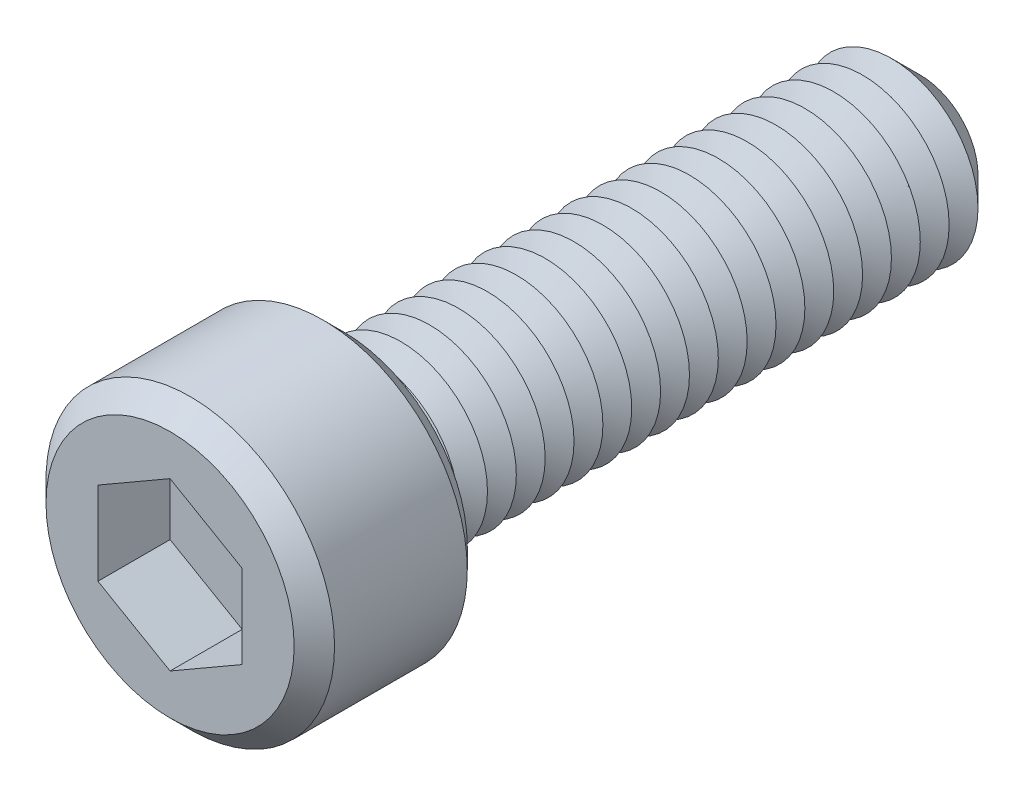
ISO-10303-21;
HEADER;
FILE_DESCRIPTION(('STEP AP214'),'2;1');
FILE_NAME('part.step','',(''),(''),'','','');
FILE_SCHEMA(('AUTOMOTIVE_DESIGN { 1 0 10303 214 1 1 1 1 }'));
ENDSEC;
DATA;
#1=APPLICATION_CONTEXT('core data for automotive mechanical design processes');
#2=APPLICATION_PROTOCOL_DEFINITION('international standard','automotive_design',2000,#1);
#3=PRODUCT_CONTEXT('',#1,'mechanical');
#4=PRODUCT('Part','Part','',(#3));
#5=PRODUCT_RELATED_PRODUCT_CATEGORY('part','',(#4));
#6=PRODUCT_DEFINITION_FORMATION('','',#4);
#7=PRODUCT_DEFINITION_CONTEXT('part definition',#1,'design');
#8=PRODUCT_DEFINITION('design','',#6,#7);
#9=PRODUCT_DEFINITION_SHAPE('','',#8);
#10=(LENGTH_UNIT() NAMED_UNIT(*) SI_UNIT(.MILLI.,.METRE.));
#11=(NAMED_UNIT(*) PLANE_ANGLE_UNIT() SI_UNIT($,.RADIAN.));
#12=(NAMED_UNIT(*) SI_UNIT($,.STERADIAN.) SOLID_ANGLE_UNIT());
#13=UNCERTAINTY_MEASURE_WITH_UNIT(LENGTH_MEASURE(1.E-05),#10,'distance_accuracy_value','');
#14=(GEOMETRIC_REPRESENTATION_CONTEXT(3) GLOBAL_UNCERTAINTY_ASSIGNED_CONTEXT((#13)) GLOBAL_UNIT_ASSIGNED_CONTEXT((#10,
#11,#12)) REPRESENTATION_CONTEXT('',''));
#15=CARTESIAN_POINT('',(0.,0.,0.));
#16=DIRECTION('',(0.,0.,1.));
#17=DIRECTION('',(1.,0.,0.));
#18=AXIS2_PLACEMENT_3D('',#15,#16,#17);
#19=CARTESIAN_POINT('',(0.,0.,6.));
#20=DIRECTION('',(0.,0.,-1.));
#21=DIRECTION('',(-1.,0.,0.));
#22=AXIS2_PLACEMENT_3D('',#19,#20,#21);
#23=CYLINDRICAL_SURFACE('',#22,5.);
#24=CARTESIAN_POINT('',(0.,0.,0.700000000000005));
#25=DIRECTION('',(0.,0.,1.));
#26=DIRECTION('',(1.,0.,0.));
#27=AXIS2_PLACEMENT_3D('',#24,#25,#26);
#28=CIRCLE('',#27,5.);
#29=CARTESIAN_POINT('',(5.,0.,0.700000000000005));
#30=VERTEX_POINT('',#29);
#31=EDGE_CURVE('E328',#30,#30,#28,.T.);
#32=ORIENTED_EDGE('',*,*,#31,.T.);
#33=EDGE_LOOP('',(#32));
#34=FACE_BOUND('',#33,.T.);
#35=CARTESIAN_POINT('',(0.,0.,5.29999999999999));
#36=DIRECTION('',(0.,0.,1.));
#37=DIRECTION('',(1.,0.,0.));
#38=AXIS2_PLACEMENT_3D('',#35,#36,#37);
#39=CIRCLE('',#38,5.);
#40=CARTESIAN_POINT('',(5.,0.,5.29999999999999));
#41=VERTEX_POINT('',#40);
#42=EDGE_CURVE('E324',#41,#41,#39,.F.);
#43=ORIENTED_EDGE('',*,*,#42,.T.);
#44=EDGE_LOOP('',(#43));
#45=FACE_BOUND('',#44,.T.);
#46=ADVANCED_FACE('F39',(#34,#45),#23,.T.);
#47=CARTESIAN_POINT('',(0.,0.,6.));
#48=DIRECTION('',(0.,0.,1.));
#49=DIRECTION('',(1.,0.,0.));
#50=AXIS2_PLACEMENT_3D('',#47,#48,#49);
#51=PLANE('',#50);
#52=CARTESIAN_POINT('',(0.,0.,6.));
#53=DIRECTION('',(0.,0.,1.));
#54=DIRECTION('',(1.,0.,0.));
#55=AXIS2_PLACEMENT_3D('',#52,#53,#54);
#56=CIRCLE('',#55,4.29999999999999);
#57=CARTESIAN_POINT('',(4.29999999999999,0.,6.));
#58=VERTEX_POINT('',#57);
#59=EDGE_CURVE('E11',#58,#58,#56,.T.);
#60=ORIENTED_EDGE('',*,*,#59,.T.);
#61=EDGE_LOOP('',(#60));
#62=FACE_BOUND('',#61,.T.);
#63=DIRECTION('',(-0.866025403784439,0.5,0.));
#64=VECTOR('',#63,1.);
#65=CARTESIAN_POINT('',(2.5,1.44337567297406,6.));
#66=LINE('',#65,#64);
#67=CARTESIAN_POINT('',(2.5,1.44337567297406,6.));
#68=VERTEX_POINT('',#67);
#69=CARTESIAN_POINT('',(0.,2.88675134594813,6.));
#70=VERTEX_POINT('',#69);
#71=EDGE_CURVE('E55',#68,#70,#66,.T.);
#72=ORIENTED_EDGE('',*,*,#71,.F.);
#73=DIRECTION('',(0.,1.,0.));
#74=VECTOR('',#73,1.);
#75=CARTESIAN_POINT('',(2.5,-1.44337567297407,6.));
#76=LINE('',#75,#74);
#77=CARTESIAN_POINT('',(2.5,-1.44337567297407,6.));
#78=VERTEX_POINT('',#77);
#79=EDGE_CURVE('E151',#78,#68,#76,.T.);
#80=ORIENTED_EDGE('',*,*,#79,.F.);
#81=DIRECTION('',(0.866025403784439,0.5,0.));
#82=VECTOR('',#81,1.);
#83=CARTESIAN_POINT('',(0.,-2.88675134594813,6.));
#84=LINE('',#83,#82);
#85=CARTESIAN_POINT('',(0.,-2.88675134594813,6.));
#86=VERTEX_POINT('',#85);
#87=EDGE_CURVE('E148',#86,#78,#84,.T.);
#88=ORIENTED_EDGE('',*,*,#87,.F.);
#89=DIRECTION('',(0.866025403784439,-0.5,0.));
#90=VECTOR('',#89,1.);
#91=CARTESIAN_POINT('',(-2.5,-1.44337567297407,6.));
#92=LINE('',#91,#90);
#93=CARTESIAN_POINT('',(-2.5,-1.44337567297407,6.));
#94=VERTEX_POINT('',#93);
#95=EDGE_CURVE('E103',#94,#86,#92,.T.);
#96=ORIENTED_EDGE('',*,*,#95,.F.);
#97=DIRECTION('',(0.,-1.,0.));
#98=VECTOR('',#97,1.);
#99=CARTESIAN_POINT('',(-2.5,1.44337567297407,6.));
#100=LINE('',#99,#98);
#101=CARTESIAN_POINT('',(-2.5,1.44337567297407,6.));
#102=VERTEX_POINT('',#101);
#103=EDGE_CURVE('E142',#102,#94,#100,.T.);
#104=ORIENTED_EDGE('',*,*,#103,.F.);
#105=DIRECTION('',(-0.866025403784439,-0.5,0.));
#106=VECTOR('',#105,1.);
#107=CARTESIAN_POINT('',(0.,2.88675134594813,6.));
#108=LINE('',#107,#106);
#109=EDGE_CURVE('E137',#70,#102,#108,.T.);
#110=ORIENTED_EDGE('',*,*,#109,.F.);
#111=EDGE_LOOP('',(#72,#80,#88,#96,#104,#110));
#112=FACE_BOUND('',#111,.T.);
#113=ADVANCED_FACE('F347',(#62,#112),#51,.T.);
#114=CARTESIAN_POINT('',(0.,0.,0.));
#115=DIRECTION('',(0.,0.,1.));
#116=DIRECTION('',(1.,0.,0.));
#117=AXIS2_PLACEMENT_3D('',#114,#115,#116);
#118=PLANE('',#117);
#119=CARTESIAN_POINT('',(0.,0.,0.));
#120=DIRECTION('',(0.,0.,1.));
#121=DIRECTION('',(1.,0.,0.));
#122=AXIS2_PLACEMENT_3D('',#119,#120,#121);
#123=CIRCLE('',#122,4.29999999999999);
#124=CARTESIAN_POINT('',(4.29999999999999,0.,0.));
#125=VERTEX_POINT('',#124);
#126=EDGE_CURVE('E48',#125,#125,#123,.F.);
#127=ORIENTED_EDGE('',*,*,#126,.T.);
#128=EDGE_LOOP('',(#127));
#129=FACE_BOUND('',#128,.T.);
#130=CARTESIAN_POINT('',(0.,0.,0.));
#131=DIRECTION('',(0.,0.,1.));
#132=DIRECTION('',(1.,0.,0.));
#133=AXIS2_PLACEMENT_3D('',#130,#131,#132);
#134=CIRCLE('',#133,3.);
#135=CARTESIAN_POINT('',(3.,0.,0.));
#136=VERTEX_POINT('',#135);
#137=EDGE_CURVE('E316',#136,#136,#134,.T.);
#138=ORIENTED_EDGE('',*,*,#137,.T.);
#139=EDGE_LOOP('',(#138));
#140=FACE_BOUND('',#139,.T.);
#141=ADVANCED_FACE('F336',(#129,#140),#118,.F.);
#142=CARTESIAN_POINT('',(0.,0.,0.));
#143=DIRECTION('',(0.,0.,1.));
#144=DIRECTION('',(1.,0.,0.));
#145=AXIS2_PLACEMENT_3D('',#142,#143,#144);
#146=CONICAL_SURFACE('',#145,3.,1.0471975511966);
#147=CARTESIAN_POINT('',(0.,0.,-0.500000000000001));
#148=DIRECTION('',(0.,0.,1.));
#149=DIRECTION('',(1.,0.,0.));
#150=AXIS2_PLACEMENT_3D('',#147,#148,#149);
#151=CIRCLE('',#150,2.13397459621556);
#152=CARTESIAN_POINT('',(2.13397459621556,0.,-0.500000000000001));
#153=VERTEX_POINT('',#152);
#154=EDGE_CURVE('E312',#153,#153,#151,.T.);
#155=ORIENTED_EDGE('',*,*,#154,.T.);
#156=EDGE_LOOP('',(#155));
#157=FACE_BOUND('',#156,.T.);
#158=ORIENTED_EDGE('',*,*,#137,.F.);
#159=EDGE_LOOP('',(#158));
#160=FACE_BOUND('',#159,.T.);
#161=ADVANCED_FACE('F548',(#157,#160),#146,.T.);
#162=CARTESIAN_POINT('',(0.,0.,-0.500000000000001));
#163=DIRECTION('',(0.,0.,-1.));
#164=DIRECTION('',(-1.,0.,0.));
#165=AXIS2_PLACEMENT_3D('',#162,#163,#164);
#166=CONICAL_SURFACE('',#165,2.13397459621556,1.0471975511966);
#167=CARTESIAN_POINT('',(0.,0.,-1.));
#168=DIRECTION('',(0.,0.,1.));
#169=DIRECTION('',(1.,0.,0.));
#170=AXIS2_PLACEMENT_3D('',#167,#168,#169);
#171=CIRCLE('',#170,3.);
#172=CARTESIAN_POINT('',(3.,0.,-1.));
#173=VERTEX_POINT('',#172);
#174=EDGE_CURVE('E308',#173,#173,#171,.T.);
#175=ORIENTED_EDGE('',*,*,#174,.T.);
#176=EDGE_LOOP('',(#175));
#177=FACE_BOUND('',#176,.T.);
#178=ORIENTED_EDGE('',*,*,#154,.F.);
#179=EDGE_LOOP('',(#178));
#180=FACE_BOUND('',#179,.T.);
#181=ADVANCED_FACE('F544',(#177,#180),#166,.T.);
#182=CARTESIAN_POINT('',(0.,0.,-1.));
#183=DIRECTION('',(0.,0.,1.));
#184=DIRECTION('',(1.,0.,0.));
#185=AXIS2_PLACEMENT_3D('',#182,#183,#184);
#186=CONICAL_SURFACE('',#185,3.,1.0471975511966);
#187=CARTESIAN_POINT('',(0.,0.,-1.5));
#188=DIRECTION('',(0.,0.,1.));
#189=DIRECTION('',(1.,0.,0.));
#190=AXIS2_PLACEMENT_3D('',#187,#188,#189);
#191=CIRCLE('',#190,2.13397459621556);
#192=CARTESIAN_POINT('',(2.13397459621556,0.,-1.5));
#193=VERTEX_POINT('',#192);
#194=EDGE_CURVE('E304',#193,#193,#191,.T.);
#195=ORIENTED_EDGE('',*,*,#194,.T.);
#196=EDGE_LOOP('',(#195));
#197=FACE_BOUND('',#196,.T.);
#198=ORIENTED_EDGE('',*,*,#174,.F.);
#199=EDGE_LOOP('',(#198));
#200=FACE_BOUND('',#199,.T.);
#201=ADVANCED_FACE('F540',(#197,#200),#186,.T.);
#202=CARTESIAN_POINT('',(0.,0.,-1.5));
#203=DIRECTION('',(0.,0.,-1.));
#204=DIRECTION('',(-1.,0.,0.));
#205=AXIS2_PLACEMENT_3D('',#202,#203,#204);
#206=CONICAL_SURFACE('',#205,2.13397459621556,1.0471975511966);
#207=CARTESIAN_POINT('',(0.,0.,-2.));
#208=DIRECTION('',(0.,0.,1.));
#209=DIRECTION('',(1.,0.,0.));
#210=AXIS2_PLACEMENT_3D('',#207,#208,#209);
#211=CIRCLE('',#210,3.);
#212=CARTESIAN_POINT('',(3.,0.,-2.));
#213=VERTEX_POINT('',#212);
#214=EDGE_CURVE('E301',#213,#213,#211,.T.);
#215=ORIENTED_EDGE('',*,*,#214,.T.);
#216=EDGE_LOOP('',(#215));
#217=FACE_BOUND('',#216,.T.);
#218=ORIENTED_EDGE('',*,*,#194,.F.);
#219=EDGE_LOOP('',(#218));
#220=FACE_BOUND('',#219,.T.);
#221=ADVANCED_FACE('F536',(#217,#220),#206,.T.);
#222=CARTESIAN_POINT('',(0.,0.,-2.));
#223=DIRECTION('',(0.,0.,1.));
#224=DIRECTION('',(1.,0.,0.));
#225=AXIS2_PLACEMENT_3D('',#222,#223,#224);
#226=CONICAL_SURFACE('',#225,3.,1.0471975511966);
#227=CARTESIAN_POINT('',(0.,0.,-2.5));
#228=DIRECTION('',(0.,0.,1.));
#229=DIRECTION('',(1.,0.,0.));
#230=AXIS2_PLACEMENT_3D('',#227,#228,#229);
#231=CIRCLE('',#230,2.13397459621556);
#232=CARTESIAN_POINT('',(2.13397459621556,0.,-2.5));
#233=VERTEX_POINT('',#232);
#234=EDGE_CURVE('E297',#233,#233,#231,.T.);
#235=ORIENTED_EDGE('',*,*,#234,.T.);
#236=EDGE_LOOP('',(#235));
#237=FACE_BOUND('',#236,.T.);
#238=ORIENTED_EDGE('',*,*,#214,.F.);
#239=EDGE_LOOP('',(#238));
#240=FACE_BOUND('',#239,.T.);
#241=ADVANCED_FACE('F532',(#237,#240),#226,.T.);
#242=CARTESIAN_POINT('',(0.,0.,-2.5));
#243=DIRECTION('',(0.,0.,-1.));
#244=DIRECTION('',(-1.,0.,0.));
#245=AXIS2_PLACEMENT_3D('',#242,#243,#244);
#246=CONICAL_SURFACE('',#245,2.13397459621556,1.0471975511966);
#247=CARTESIAN_POINT('',(0.,0.,-3.));
#248=DIRECTION('',(0.,0.,1.));
#249=DIRECTION('',(1.,0.,0.));
#250=AXIS2_PLACEMENT_3D('',#247,#248,#249);
#251=CIRCLE('',#250,3.);
#252=CARTESIAN_POINT('',(3.,0.,-3.));
#253=VERTEX_POINT('',#252);
#254=EDGE_CURVE('E293',#253,#253,#251,.T.);
#255=ORIENTED_EDGE('',*,*,#254,.T.);
#256=EDGE_LOOP('',(#255));
#257=FACE_BOUND('',#256,.T.);
#258=ORIENTED_EDGE('',*,*,#234,.F.);
#259=EDGE_LOOP('',(#258));
#260=FACE_BOUND('',#259,.T.);
#261=ADVANCED_FACE('F528',(#257,#260),#246,.T.);
#262=CARTESIAN_POINT('',(0.,0.,-3.));
#263=DIRECTION('',(0.,0.,1.));
#264=DIRECTION('',(1.,0.,0.));
#265=AXIS2_PLACEMENT_3D('',#262,#263,#264);
#266=CONICAL_SURFACE('',#265,3.,1.0471975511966);
#267=CARTESIAN_POINT('',(0.,0.,-3.5));
#268=DIRECTION('',(0.,0.,1.));
#269=DIRECTION('',(1.,0.,0.));
#270=AXIS2_PLACEMENT_3D('',#267,#268,#269);
#271=CIRCLE('',#270,2.13397459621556);
#272=CARTESIAN_POINT('',(2.13397459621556,0.,-3.5));
#273=VERTEX_POINT('',#272);
#274=EDGE_CURVE('E289',#273,#273,#271,.T.);
#275=ORIENTED_EDGE('',*,*,#274,.T.);
#276=EDGE_LOOP('',(#275));
#277=FACE_BOUND('',#276,.T.);
#278=ORIENTED_EDGE('',*,*,#254,.F.);
#279=EDGE_LOOP('',(#278));
#280=FACE_BOUND('',#279,.T.);
#281=ADVANCED_FACE('F524',(#277,#280),#266,.T.);
#282=CARTESIAN_POINT('',(0.,0.,-3.5));
#283=DIRECTION('',(0.,0.,-1.));
#284=DIRECTION('',(-1.,0.,0.));
#285=AXIS2_PLACEMENT_3D('',#282,#283,#284);
#286=CONICAL_SURFACE('',#285,2.13397459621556,1.0471975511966);
#287=CARTESIAN_POINT('',(0.,0.,-4.));
#288=DIRECTION('',(0.,0.,1.));
#289=DIRECTION('',(1.,0.,0.));
#290=AXIS2_PLACEMENT_3D('',#287,#288,#289);
#291=CIRCLE('',#290,3.);
#292=CARTESIAN_POINT('',(3.,0.,-4.));
#293=VERTEX_POINT('',#292);
#294=EDGE_CURVE('E285',#293,#293,#291,.T.);
#295=ORIENTED_EDGE('',*,*,#294,.T.);
#296=EDGE_LOOP('',(#295));
#297=FACE_BOUND('',#296,.T.);
#298=ORIENTED_EDGE('',*,*,#274,.F.);
#299=EDGE_LOOP('',(#298));
#300=FACE_BOUND('',#299,.T.);
#301=ADVANCED_FACE('F520',(#297,#300),#286,.T.);
#302=CARTESIAN_POINT('',(0.,0.,-4.));
#303=DIRECTION('',(0.,0.,1.));
#304=DIRECTION('',(1.,0.,0.));
#305=AXIS2_PLACEMENT_3D('',#302,#303,#304);
#306=CONICAL_SURFACE('',#305,3.,1.0471975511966);
#307=CARTESIAN_POINT('',(0.,0.,-4.5));
#308=DIRECTION('',(0.,0.,1.));
#309=DIRECTION('',(1.,0.,0.));
#310=AXIS2_PLACEMENT_3D('',#307,#308,#309);
#311=CIRCLE('',#310,2.13397459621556);
#312=CARTESIAN_POINT('',(2.13397459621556,0.,-4.5));
#313=VERTEX_POINT('',#312);
#314=EDGE_CURVE('E281',#313,#313,#311,.T.);
#315=ORIENTED_EDGE('',*,*,#314,.T.);
#316=EDGE_LOOP('',(#315));
#317=FACE_BOUND('',#316,.T.);
#318=ORIENTED_EDGE('',*,*,#294,.F.);
#319=EDGE_LOOP('',(#318));
#320=FACE_BOUND('',#319,.T.);
#321=ADVANCED_FACE('F516',(#317,#320),#306,.T.);
#322=CARTESIAN_POINT('',(0.,0.,-4.5));
#323=DIRECTION('',(0.,0.,-1.));
#324=DIRECTION('',(-1.,0.,0.));
#325=AXIS2_PLACEMENT_3D('',#322,#323,#324);
#326=CONICAL_SURFACE('',#325,2.13397459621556,1.0471975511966);
#327=CARTESIAN_POINT('',(0.,0.,-5.));
#328=DIRECTION('',(0.,0.,1.));
#329=DIRECTION('',(1.,0.,0.));
#330=AXIS2_PLACEMENT_3D('',#327,#328,#329);
#331=CIRCLE('',#330,3.);
#332=CARTESIAN_POINT('',(3.,0.,-5.));
#333=VERTEX_POINT('',#332);
#334=EDGE_CURVE('E277',#333,#333,#331,.T.);
#335=ORIENTED_EDGE('',*,*,#334,.T.);
#336=EDGE_LOOP('',(#335));
#337=FACE_BOUND('',#336,.T.);
#338=ORIENTED_EDGE('',*,*,#314,.F.);
#339=EDGE_LOOP('',(#338));
#340=FACE_BOUND('',#339,.T.);
#341=ADVANCED_FACE('F512',(#337,#340),#326,.T.);
#342=CARTESIAN_POINT('',(0.,0.,-5.));
#343=DIRECTION('',(0.,0.,1.));
#344=DIRECTION('',(1.,0.,0.));
#345=AXIS2_PLACEMENT_3D('',#342,#343,#344);
#346=CONICAL_SURFACE('',#345,3.,1.0471975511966);
#347=CARTESIAN_POINT('',(0.,0.,-5.5));
#348=DIRECTION('',(0.,0.,1.));
#349=DIRECTION('',(1.,0.,0.));
#350=AXIS2_PLACEMENT_3D('',#347,#348,#349);
#351=CIRCLE('',#350,2.13397459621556);
#352=CARTESIAN_POINT('',(2.13397459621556,0.,-5.5));
#353=VERTEX_POINT('',#352);
#354=EDGE_CURVE('E273',#353,#353,#351,.T.);
#355=ORIENTED_EDGE('',*,*,#354,.T.);
#356=EDGE_LOOP('',(#355));
#357=FACE_BOUND('',#356,.T.);
#358=ORIENTED_EDGE('',*,*,#334,.F.);
#359=EDGE_LOOP('',(#358));
#360=FACE_BOUND('',#359,.T.);
#361=ADVANCED_FACE('F508',(#357,#360),#346,.T.);
#362=CARTESIAN_POINT('',(0.,0.,-5.5));
#363=DIRECTION('',(0.,0.,-1.));
#364=DIRECTION('',(-1.,0.,0.));
#365=AXIS2_PLACEMENT_3D('',#362,#363,#364);
#366=CONICAL_SURFACE('',#365,2.13397459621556,1.0471975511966);
#367=CARTESIAN_POINT('',(0.,0.,-6.));
#368=DIRECTION('',(0.,0.,1.));
#369=DIRECTION('',(1.,0.,0.));
#370=AXIS2_PLACEMENT_3D('',#367,#368,#369);
#371=CIRCLE('',#370,3.);
#372=CARTESIAN_POINT('',(3.,0.,-6.));
#373=VERTEX_POINT('',#372);
#374=EDGE_CURVE('E269',#373,#373,#371,.T.);
#375=ORIENTED_EDGE('',*,*,#374,.T.);
#376=EDGE_LOOP('',(#375));
#377=FACE_BOUND('',#376,.T.);
#378=ORIENTED_EDGE('',*,*,#354,.F.);
#379=EDGE_LOOP('',(#378));
#380=FACE_BOUND('',#379,.T.);
#381=ADVANCED_FACE('F504',(#377,#380),#366,.T.);
#382=CARTESIAN_POINT('',(0.,0.,-6.));
#383=DIRECTION('',(0.,0.,1.));
#384=DIRECTION('',(1.,0.,0.));
#385=AXIS2_PLACEMENT_3D('',#382,#383,#384);
#386=CONICAL_SURFACE('',#385,3.,1.0471975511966);
#387=CARTESIAN_POINT('',(0.,0.,-6.5));
#388=DIRECTION('',(0.,0.,1.));
#389=DIRECTION('',(1.,0.,0.));
#390=AXIS2_PLACEMENT_3D('',#387,#388,#389);
#391=CIRCLE('',#390,2.13397459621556);
#392=CARTESIAN_POINT('',(2.13397459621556,0.,-6.5));
#393=VERTEX_POINT('',#392);
#394=EDGE_CURVE('E265',#393,#393,#391,.T.);
#395=ORIENTED_EDGE('',*,*,#394,.T.);
#396=EDGE_LOOP('',(#395));
#397=FACE_BOUND('',#396,.T.);
#398=ORIENTED_EDGE('',*,*,#374,.F.);
#399=EDGE_LOOP('',(#398));
#400=FACE_BOUND('',#399,.T.);
#401=ADVANCED_FACE('F500',(#397,#400),#386,.T.);
#402=CARTESIAN_POINT('',(0.,0.,-6.5));
#403=DIRECTION('',(0.,0.,-1.));
#404=DIRECTION('',(-1.,0.,0.));
#405=AXIS2_PLACEMENT_3D('',#402,#403,#404);
#406=CONICAL_SURFACE('',#405,2.13397459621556,1.0471975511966);
#407=CARTESIAN_POINT('',(0.,0.,-7.));
#408=DIRECTION('',(0.,0.,1.));
#409=DIRECTION('',(1.,0.,0.));
#410=AXIS2_PLACEMENT_3D('',#407,#408,#409);
#411=CIRCLE('',#410,3.);
#412=CARTESIAN_POINT('',(3.,0.,-7.));
#413=VERTEX_POINT('',#412);
#414=EDGE_CURVE('E261',#413,#413,#411,.T.);
#415=ORIENTED_EDGE('',*,*,#414,.T.);
#416=EDGE_LOOP('',(#415));
#417=FACE_BOUND('',#416,.T.);
#418=ORIENTED_EDGE('',*,*,#394,.F.);
#419=EDGE_LOOP('',(#418));
#420=FACE_BOUND('',#419,.T.);
#421=ADVANCED_FACE('F496',(#417,#420),#406,.T.);
#422=CARTESIAN_POINT('',(0.,0.,-7.));
#423=DIRECTION('',(0.,0.,1.));
#424=DIRECTION('',(1.,0.,0.));
#425=AXIS2_PLACEMENT_3D('',#422,#423,#424);
#426=CONICAL_SURFACE('',#425,3.,1.0471975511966);
#427=CARTESIAN_POINT('',(0.,0.,-7.5));
#428=DIRECTION('',(0.,0.,1.));
#429=DIRECTION('',(1.,0.,0.));
#430=AXIS2_PLACEMENT_3D('',#427,#428,#429);
#431=CIRCLE('',#430,2.13397459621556);
#432=CARTESIAN_POINT('',(2.13397459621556,0.,-7.5));
#433=VERTEX_POINT('',#432);
#434=EDGE_CURVE('E257',#433,#433,#431,.T.);
#435=ORIENTED_EDGE('',*,*,#434,.T.);
#436=EDGE_LOOP('',(#435));
#437=FACE_BOUND('',#436,.T.);
#438=ORIENTED_EDGE('',*,*,#414,.F.);
#439=EDGE_LOOP('',(#438));
#440=FACE_BOUND('',#439,.T.);
#441=ADVANCED_FACE('F492',(#437,#440),#426,.T.);
#442=CARTESIAN_POINT('',(0.,0.,-7.5));
#443=DIRECTION('',(0.,0.,-1.));
#444=DIRECTION('',(-1.,0.,0.));
#445=AXIS2_PLACEMENT_3D('',#442,#443,#444);
#446=CONICAL_SURFACE('',#445,2.13397459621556,1.0471975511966);
#447=CARTESIAN_POINT('',(0.,0.,-8.));
#448=DIRECTION('',(0.,0.,1.));
#449=DIRECTION('',(1.,0.,0.));
#450=AXIS2_PLACEMENT_3D('',#447,#448,#449);
#451=CIRCLE('',#450,3.);
#452=CARTESIAN_POINT('',(3.,0.,-8.));
#453=VERTEX_POINT('',#452);
#454=EDGE_CURVE('E253',#453,#453,#451,.T.);
#455=ORIENTED_EDGE('',*,*,#454,.T.);
#456=EDGE_LOOP('',(#455));
#457=FACE_BOUND('',#456,.T.);
#458=ORIENTED_EDGE('',*,*,#434,.F.);
#459=EDGE_LOOP('',(#458));
#460=FACE_BOUND('',#459,.T.);
#461=ADVANCED_FACE('F488',(#457,#460),#446,.T.);
#462=CARTESIAN_POINT('',(0.,0.,-8.));
#463=DIRECTION('',(0.,0.,1.));
#464=DIRECTION('',(1.,0.,0.));
#465=AXIS2_PLACEMENT_3D('',#462,#463,#464);
#466=CONICAL_SURFACE('',#465,3.,1.0471975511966);
#467=CARTESIAN_POINT('',(0.,0.,-8.5));
#468=DIRECTION('',(0.,0.,1.));
#469=DIRECTION('',(1.,0.,0.));
#470=AXIS2_PLACEMENT_3D('',#467,#468,#469);
#471=CIRCLE('',#470,2.13397459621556);
#472=CARTESIAN_POINT('',(2.13397459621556,0.,-8.5));
#473=VERTEX_POINT('',#472);
#474=EDGE_CURVE('E249',#473,#473,#471,.T.);
#475=ORIENTED_EDGE('',*,*,#474,.T.);
#476=EDGE_LOOP('',(#475));
#477=FACE_BOUND('',#476,.T.);
#478=ORIENTED_EDGE('',*,*,#454,.F.);
#479=EDGE_LOOP('',(#478));
#480=FACE_BOUND('',#479,.T.);
#481=ADVANCED_FACE('F484',(#477,#480),#466,.T.);
#482=CARTESIAN_POINT('',(0.,0.,-8.5));
#483=DIRECTION('',(0.,0.,-1.));
#484=DIRECTION('',(-1.,0.,0.));
#485=AXIS2_PLACEMENT_3D('',#482,#483,#484);
#486=CONICAL_SURFACE('',#485,2.13397459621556,1.0471975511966);
#487=CARTESIAN_POINT('',(0.,0.,-9.));
#488=DIRECTION('',(0.,0.,1.));
#489=DIRECTION('',(1.,0.,0.));
#490=AXIS2_PLACEMENT_3D('',#487,#488,#489);
#491=CIRCLE('',#490,3.);
#492=CARTESIAN_POINT('',(3.,0.,-9.));
#493=VERTEX_POINT('',#492);
#494=EDGE_CURVE('E245',#493,#493,#491,.T.);
#495=ORIENTED_EDGE('',*,*,#494,.T.);
#496=EDGE_LOOP('',(#495));
#497=FACE_BOUND('',#496,.T.);
#498=ORIENTED_EDGE('',*,*,#474,.F.);
#499=EDGE_LOOP('',(#498));
#500=FACE_BOUND('',#499,.T.);
#501=ADVANCED_FACE('F480',(#497,#500),#486,.T.);
#502=CARTESIAN_POINT('',(0.,0.,-9.));
#503=DIRECTION('',(0.,0.,1.));
#504=DIRECTION('',(1.,0.,0.));
#505=AXIS2_PLACEMENT_3D('',#502,#503,#504);
#506=CONICAL_SURFACE('',#505,3.,1.0471975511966);
#507=CARTESIAN_POINT('',(0.,0.,-9.5));
#508=DIRECTION('',(0.,0.,1.));
#509=DIRECTION('',(1.,0.,0.));
#510=AXIS2_PLACEMENT_3D('',#507,#508,#509);
#511=CIRCLE('',#510,2.13397459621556);
#512=CARTESIAN_POINT('',(2.13397459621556,0.,-9.5));
#513=VERTEX_POINT('',#512);
#514=EDGE_CURVE('E241',#513,#513,#511,.T.);
#515=ORIENTED_EDGE('',*,*,#514,.T.);
#516=EDGE_LOOP('',(#515));
#517=FACE_BOUND('',#516,.T.);
#518=ORIENTED_EDGE('',*,*,#494,.F.);
#519=EDGE_LOOP('',(#518));
#520=FACE_BOUND('',#519,.T.);
#521=ADVANCED_FACE('F476',(#517,#520),#506,.T.);
#522=CARTESIAN_POINT('',(0.,0.,-9.5));
#523=DIRECTION('',(0.,0.,-1.));
#524=DIRECTION('',(-1.,0.,0.));
#525=AXIS2_PLACEMENT_3D('',#522,#523,#524);
#526=CONICAL_SURFACE('',#525,2.13397459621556,1.0471975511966);
#527=CARTESIAN_POINT('',(0.,0.,-10.));
#528=DIRECTION('',(0.,0.,1.));
#529=DIRECTION('',(1.,0.,0.));
#530=AXIS2_PLACEMENT_3D('',#527,#528,#529);
#531=CIRCLE('',#530,3.);
#532=CARTESIAN_POINT('',(3.,0.,-10.));
#533=VERTEX_POINT('',#532);
#534=EDGE_CURVE('E237',#533,#533,#531,.T.);
#535=ORIENTED_EDGE('',*,*,#534,.T.);
#536=EDGE_LOOP('',(#535));
#537=FACE_BOUND('',#536,.T.);
#538=ORIENTED_EDGE('',*,*,#514,.F.);
#539=EDGE_LOOP('',(#538));
#540=FACE_BOUND('',#539,.T.);
#541=ADVANCED_FACE('F472',(#537,#540),#526,.T.);
#542=CARTESIAN_POINT('',(0.,0.,-10.));
#543=DIRECTION('',(0.,0.,1.));
#544=DIRECTION('',(1.,0.,0.));
#545=AXIS2_PLACEMENT_3D('',#542,#543,#544);
#546=CONICAL_SURFACE('',#545,3.,1.0471975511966);
#547=CARTESIAN_POINT('',(0.,0.,-10.5));
#548=DIRECTION('',(0.,0.,1.));
#549=DIRECTION('',(1.,0.,0.));
#550=AXIS2_PLACEMENT_3D('',#547,#548,#549);
#551=CIRCLE('',#550,2.13397459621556);
#552=CARTESIAN_POINT('',(2.13397459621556,0.,-10.5));
#553=VERTEX_POINT('',#552);
#554=EDGE_CURVE('E233',#553,#553,#551,.T.);
#555=ORIENTED_EDGE('',*,*,#554,.T.);
#556=EDGE_LOOP('',(#555));
#557=FACE_BOUND('',#556,.T.);
#558=ORIENTED_EDGE('',*,*,#534,.F.);
#559=EDGE_LOOP('',(#558));
#560=FACE_BOUND('',#559,.T.);
#561=ADVANCED_FACE('F468',(#557,#560),#546,.T.);
#562=CARTESIAN_POINT('',(0.,0.,-10.5));
#563=DIRECTION('',(0.,0.,-1.));
#564=DIRECTION('',(-1.,0.,0.));
#565=AXIS2_PLACEMENT_3D('',#562,#563,#564);
#566=CONICAL_SURFACE('',#565,2.13397459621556,1.0471975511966);
#567=CARTESIAN_POINT('',(0.,0.,-11.));
#568=DIRECTION('',(0.,0.,1.));
#569=DIRECTION('',(1.,0.,0.));
#570=AXIS2_PLACEMENT_3D('',#567,#568,#569);
#571=CIRCLE('',#570,3.);
#572=CARTESIAN_POINT('',(3.,0.,-11.));
#573=VERTEX_POINT('',#572);
#574=EDGE_CURVE('E229',#573,#573,#571,.T.);
#575=ORIENTED_EDGE('',*,*,#574,.T.);
#576=EDGE_LOOP('',(#575));
#577=FACE_BOUND('',#576,.T.);
#578=ORIENTED_EDGE('',*,*,#554,.F.);
#579=EDGE_LOOP('',(#578));
#580=FACE_BOUND('',#579,.T.);
#581=ADVANCED_FACE('F464',(#577,#580),#566,.T.);
#582=CARTESIAN_POINT('',(0.,0.,-11.));
#583=DIRECTION('',(0.,0.,1.));
#584=DIRECTION('',(1.,0.,0.));
#585=AXIS2_PLACEMENT_3D('',#582,#583,#584);
#586=CONICAL_SURFACE('',#585,3.,1.0471975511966);
#587=CARTESIAN_POINT('',(0.,0.,-11.5));
#588=DIRECTION('',(0.,0.,1.));
#589=DIRECTION('',(1.,0.,0.));
#590=AXIS2_PLACEMENT_3D('',#587,#588,#589);
#591=CIRCLE('',#590,2.13397459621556);
#592=CARTESIAN_POINT('',(2.13397459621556,0.,-11.5));
#593=VERTEX_POINT('',#592);
#594=EDGE_CURVE('E225',#593,#593,#591,.T.);
#595=ORIENTED_EDGE('',*,*,#594,.T.);
#596=EDGE_LOOP('',(#595));
#597=FACE_BOUND('',#596,.T.);
#598=ORIENTED_EDGE('',*,*,#574,.F.);
#599=EDGE_LOOP('',(#598));
#600=FACE_BOUND('',#599,.T.);
#601=ADVANCED_FACE('F460',(#597,#600),#586,.T.);
#602=CARTESIAN_POINT('',(0.,0.,-11.5));
#603=DIRECTION('',(0.,0.,-1.));
#604=DIRECTION('',(-1.,0.,0.));
#605=AXIS2_PLACEMENT_3D('',#602,#603,#604);
#606=CONICAL_SURFACE('',#605,2.13397459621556,1.0471975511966);
#607=CARTESIAN_POINT('',(0.,0.,-12.));
#608=DIRECTION('',(0.,0.,1.));
#609=DIRECTION('',(1.,0.,0.));
#610=AXIS2_PLACEMENT_3D('',#607,#608,#609);
#611=CIRCLE('',#610,3.);
#612=CARTESIAN_POINT('',(3.,0.,-12.));
#613=VERTEX_POINT('',#612);
#614=EDGE_CURVE('E221',#613,#613,#611,.T.);
#615=ORIENTED_EDGE('',*,*,#614,.T.);
#616=EDGE_LOOP('',(#615));
#617=FACE_BOUND('',#616,.T.);
#618=ORIENTED_EDGE('',*,*,#594,.F.);
#619=EDGE_LOOP('',(#618));
#620=FACE_BOUND('',#619,.T.);
#621=ADVANCED_FACE('F456',(#617,#620),#606,.T.);
#622=CARTESIAN_POINT('',(0.,0.,-12.));
#623=DIRECTION('',(0.,0.,1.));
#624=DIRECTION('',(1.,0.,0.));
#625=AXIS2_PLACEMENT_3D('',#622,#623,#624);
#626=CONICAL_SURFACE('',#625,3.,1.0471975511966);
#627=CARTESIAN_POINT('',(0.,0.,-12.5));
#628=DIRECTION('',(0.,0.,1.));
#629=DIRECTION('',(1.,0.,0.));
#630=AXIS2_PLACEMENT_3D('',#627,#628,#629);
#631=CIRCLE('',#630,2.13397459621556);
#632=CARTESIAN_POINT('',(2.13397459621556,0.,-12.5));
#633=VERTEX_POINT('',#632);
#634=EDGE_CURVE('E217',#633,#633,#631,.T.);
#635=ORIENTED_EDGE('',*,*,#634,.T.);
#636=EDGE_LOOP('',(#635));
#637=FACE_BOUND('',#636,.T.);
#638=ORIENTED_EDGE('',*,*,#614,.F.);
#639=EDGE_LOOP('',(#638));
#640=FACE_BOUND('',#639,.T.);
#641=ADVANCED_FACE('F452',(#637,#640),#626,.T.);
#642=CARTESIAN_POINT('',(0.,0.,-12.5));
#643=DIRECTION('',(0.,0.,-1.));
#644=DIRECTION('',(-1.,0.,0.));
#645=AXIS2_PLACEMENT_3D('',#642,#643,#644);
#646=CONICAL_SURFACE('',#645,2.13397459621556,1.0471975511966);
#647=CARTESIAN_POINT('',(0.,0.,-13.));
#648=DIRECTION('',(0.,0.,1.));
#649=DIRECTION('',(1.,0.,0.));
#650=AXIS2_PLACEMENT_3D('',#647,#648,#649);
#651=CIRCLE('',#650,3.);
#652=CARTESIAN_POINT('',(3.,0.,-13.));
#653=VERTEX_POINT('',#652);
#654=EDGE_CURVE('E213',#653,#653,#651,.T.);
#655=ORIENTED_EDGE('',*,*,#654,.T.);
#656=EDGE_LOOP('',(#655));
#657=FACE_BOUND('',#656,.T.);
#658=ORIENTED_EDGE('',*,*,#634,.F.);
#659=EDGE_LOOP('',(#658));
#660=FACE_BOUND('',#659,.T.);
#661=ADVANCED_FACE('F448',(#657,#660),#646,.T.);
#662=CARTESIAN_POINT('',(0.,0.,-13.));
#663=DIRECTION('',(0.,0.,1.));
#664=DIRECTION('',(1.,0.,0.));
#665=AXIS2_PLACEMENT_3D('',#662,#663,#664);
#666=CONICAL_SURFACE('',#665,3.,1.0471975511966);
#667=CARTESIAN_POINT('',(0.,0.,-13.5));
#668=DIRECTION('',(0.,0.,1.));
#669=DIRECTION('',(1.,0.,0.));
#670=AXIS2_PLACEMENT_3D('',#667,#668,#669);
#671=CIRCLE('',#670,2.13397459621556);
#672=CARTESIAN_POINT('',(2.13397459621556,0.,-13.5));
#673=VERTEX_POINT('',#672);
#674=EDGE_CURVE('E209',#673,#673,#671,.T.);
#675=ORIENTED_EDGE('',*,*,#674,.T.);
#676=EDGE_LOOP('',(#675));
#677=FACE_BOUND('',#676,.T.);
#678=ORIENTED_EDGE('',*,*,#654,.F.);
#679=EDGE_LOOP('',(#678));
#680=FACE_BOUND('',#679,.T.);
#681=ADVANCED_FACE('F444',(#677,#680),#666,.T.);
#682=CARTESIAN_POINT('',(0.,0.,-13.5));
#683=DIRECTION('',(0.,0.,-1.));
#684=DIRECTION('',(-1.,0.,0.));
#685=AXIS2_PLACEMENT_3D('',#682,#683,#684);
#686=CONICAL_SURFACE('',#685,2.13397459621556,1.0471975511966);
#687=CARTESIAN_POINT('',(0.,0.,-14.));
#688=DIRECTION('',(0.,0.,1.));
#689=DIRECTION('',(1.,0.,0.));
#690=AXIS2_PLACEMENT_3D('',#687,#688,#689);
#691=CIRCLE('',#690,3.);
#692=CARTESIAN_POINT('',(3.,0.,-14.));
#693=VERTEX_POINT('',#692);
#694=EDGE_CURVE('E205',#693,#693,#691,.T.);
#695=ORIENTED_EDGE('',*,*,#694,.T.);
#696=EDGE_LOOP('',(#695));
#697=FACE_BOUND('',#696,.T.);
#698=ORIENTED_EDGE('',*,*,#674,.F.);
#699=EDGE_LOOP('',(#698));
#700=FACE_BOUND('',#699,.T.);
#701=ADVANCED_FACE('F440',(#697,#700),#686,.T.);
#702=CARTESIAN_POINT('',(0.,0.,-14.));
#703=DIRECTION('',(0.,0.,1.));
#704=DIRECTION('',(1.,0.,0.));
#705=AXIS2_PLACEMENT_3D('',#702,#703,#704);
#706=CONICAL_SURFACE('',#705,3.,1.0471975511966);
#707=CARTESIAN_POINT('',(0.,0.,-14.5));
#708=DIRECTION('',(0.,0.,1.));
#709=DIRECTION('',(1.,0.,0.));
#710=AXIS2_PLACEMENT_3D('',#707,#708,#709);
#711=CIRCLE('',#710,2.13397459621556);
#712=CARTESIAN_POINT('',(2.13397459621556,0.,-14.5));
#713=VERTEX_POINT('',#712);
#714=EDGE_CURVE('E201',#713,#713,#711,.T.);
#715=ORIENTED_EDGE('',*,*,#714,.T.);
#716=EDGE_LOOP('',(#715));
#717=FACE_BOUND('',#716,.T.);
#718=ORIENTED_EDGE('',*,*,#694,.F.);
#719=EDGE_LOOP('',(#718));
#720=FACE_BOUND('',#719,.T.);
#721=ADVANCED_FACE('F436',(#717,#720),#706,.T.);
#722=CARTESIAN_POINT('',(0.,0.,-14.5));
#723=DIRECTION('',(0.,0.,-1.));
#724=DIRECTION('',(-1.,0.,0.));
#725=AXIS2_PLACEMENT_3D('',#722,#723,#724);
#726=CONICAL_SURFACE('',#725,2.13397459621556,1.0471975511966);
#727=CARTESIAN_POINT('',(0.,0.,-15.));
#728=DIRECTION('',(0.,0.,1.));
#729=DIRECTION('',(1.,0.,0.));
#730=AXIS2_PLACEMENT_3D('',#727,#728,#729);
#731=CIRCLE('',#730,3.);
#732=CARTESIAN_POINT('',(3.,0.,-15.));
#733=VERTEX_POINT('',#732);
#734=EDGE_CURVE('E197',#733,#733,#731,.T.);
#735=ORIENTED_EDGE('',*,*,#734,.T.);
#736=EDGE_LOOP('',(#735));
#737=FACE_BOUND('',#736,.T.);
#738=ORIENTED_EDGE('',*,*,#714,.F.);
#739=EDGE_LOOP('',(#738));
#740=FACE_BOUND('',#739,.T.);
#741=ADVANCED_FACE('F432',(#737,#740),#726,.T.);
#742=CARTESIAN_POINT('',(0.,0.,-15.));
#743=DIRECTION('',(0.,0.,1.));
#744=DIRECTION('',(1.,0.,0.));
#745=AXIS2_PLACEMENT_3D('',#742,#743,#744);
#746=CONICAL_SURFACE('',#745,3.,1.0471975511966);
#747=CARTESIAN_POINT('',(0.,0.,-15.5));
#748=DIRECTION('',(0.,0.,1.));
#749=DIRECTION('',(1.,0.,0.));
#750=AXIS2_PLACEMENT_3D('',#747,#748,#749);
#751=CIRCLE('',#750,2.13397459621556);
#752=CARTESIAN_POINT('',(2.13397459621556,0.,-15.5));
#753=VERTEX_POINT('',#752);
#754=EDGE_CURVE('E193',#753,#753,#751,.T.);
#755=ORIENTED_EDGE('',*,*,#754,.T.);
#756=EDGE_LOOP('',(#755));
#757=FACE_BOUND('',#756,.T.);
#758=ORIENTED_EDGE('',*,*,#734,.F.);
#759=EDGE_LOOP('',(#758));
#760=FACE_BOUND('',#759,.T.);
#761=ADVANCED_FACE('F428',(#757,#760),#746,.T.);
#762=CARTESIAN_POINT('',(0.,0.,-15.5));
#763=DIRECTION('',(0.,0.,-1.));
#764=DIRECTION('',(-1.,0.,0.));
#765=AXIS2_PLACEMENT_3D('',#762,#763,#764);
#766=CONICAL_SURFACE('',#765,2.13397459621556,1.0471975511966);
#767=CARTESIAN_POINT('',(0.,0.,-16.));
#768=DIRECTION('',(0.,0.,1.));
#769=DIRECTION('',(1.,0.,0.));
#770=AXIS2_PLACEMENT_3D('',#767,#768,#769);
#771=CIRCLE('',#770,3.);
#772=CARTESIAN_POINT('',(3.,0.,-16.));
#773=VERTEX_POINT('',#772);
#774=EDGE_CURVE('E189',#773,#773,#771,.T.);
#775=ORIENTED_EDGE('',*,*,#774,.T.);
#776=EDGE_LOOP('',(#775));
#777=FACE_BOUND('',#776,.T.);
#778=ORIENTED_EDGE('',*,*,#754,.F.);
#779=EDGE_LOOP('',(#778));
#780=FACE_BOUND('',#779,.T.);
#781=ADVANCED_FACE('F424',(#777,#780),#766,.T.);
#782=CARTESIAN_POINT('',(0.,0.,-16.));
#783=DIRECTION('',(0.,0.,1.));
#784=DIRECTION('',(1.,0.,0.));
#785=AXIS2_PLACEMENT_3D('',#782,#783,#784);
#786=CONICAL_SURFACE('',#785,3.,1.0471975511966);
#787=CARTESIAN_POINT('',(0.,0.,-16.5));
#788=DIRECTION('',(0.,0.,1.));
#789=DIRECTION('',(1.,0.,0.));
#790=AXIS2_PLACEMENT_3D('',#787,#788,#789);
#791=CIRCLE('',#790,2.13397459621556);
#792=CARTESIAN_POINT('',(2.13397459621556,0.,-16.5));
#793=VERTEX_POINT('',#792);
#794=EDGE_CURVE('E185',#793,#793,#791,.T.);
#795=ORIENTED_EDGE('',*,*,#794,.T.);
#796=EDGE_LOOP('',(#795));
#797=FACE_BOUND('',#796,.T.);
#798=ORIENTED_EDGE('',*,*,#774,.F.);
#799=EDGE_LOOP('',(#798));
#800=FACE_BOUND('',#799,.T.);
#801=ADVANCED_FACE('F420',(#797,#800),#786,.T.);
#802=CARTESIAN_POINT('',(0.,0.,-16.5));
#803=DIRECTION('',(0.,0.,-1.));
#804=DIRECTION('',(-1.,0.,0.));
#805=AXIS2_PLACEMENT_3D('',#802,#803,#804);
#806=CONICAL_SURFACE('',#805,2.13397459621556,1.0471975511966);
#807=CARTESIAN_POINT('',(0.,0.,-17.));
#808=DIRECTION('',(0.,0.,1.));
#809=DIRECTION('',(1.,0.,0.));
#810=AXIS2_PLACEMENT_3D('',#807,#808,#809);
#811=CIRCLE('',#810,3.);
#812=CARTESIAN_POINT('',(3.,0.,-17.));
#813=VERTEX_POINT('',#812);
#814=EDGE_CURVE('E181',#813,#813,#811,.T.);
#815=ORIENTED_EDGE('',*,*,#814,.T.);
#816=EDGE_LOOP('',(#815));
#817=FACE_BOUND('',#816,.T.);
#818=ORIENTED_EDGE('',*,*,#794,.F.);
#819=EDGE_LOOP('',(#818));
#820=FACE_BOUND('',#819,.T.);
#821=ADVANCED_FACE('F416',(#817,#820),#806,.T.);
#822=CARTESIAN_POINT('',(0.,0.,-17.));
#823=DIRECTION('',(0.,0.,1.));
#824=DIRECTION('',(1.,0.,0.));
#825=AXIS2_PLACEMENT_3D('',#822,#823,#824);
#826=CONICAL_SURFACE('',#825,3.,1.0471975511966);
#827=CARTESIAN_POINT('',(0.,0.,-17.5));
#828=DIRECTION('',(0.,0.,1.));
#829=DIRECTION('',(1.,0.,0.));
#830=AXIS2_PLACEMENT_3D('',#827,#828,#829);
#831=CIRCLE('',#830,2.13397459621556);
#832=CARTESIAN_POINT('',(2.13397459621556,0.,-17.5));
#833=VERTEX_POINT('',#832);
#834=EDGE_CURVE('E177',#833,#833,#831,.T.);
#835=ORIENTED_EDGE('',*,*,#834,.T.);
#836=EDGE_LOOP('',(#835));
#837=FACE_BOUND('',#836,.T.);
#838=ORIENTED_EDGE('',*,*,#814,.F.);
#839=EDGE_LOOP('',(#838));
#840=FACE_BOUND('',#839,.T.);
#841=ADVANCED_FACE('F412',(#837,#840),#826,.T.);
#842=CARTESIAN_POINT('',(0.,0.,-17.5));
#843=DIRECTION('',(0.,0.,-1.));
#844=DIRECTION('',(-1.,0.,0.));
#845=AXIS2_PLACEMENT_3D('',#842,#843,#844);
#846=CONICAL_SURFACE('',#845,2.13397459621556,1.0471975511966);
#847=CARTESIAN_POINT('',(0.,0.,-18.));
#848=DIRECTION('',(0.,0.,1.));
#849=DIRECTION('',(1.,0.,0.));
#850=AXIS2_PLACEMENT_3D('',#847,#848,#849);
#851=CIRCLE('',#850,3.);
#852=CARTESIAN_POINT('',(3.,0.,-18.));
#853=VERTEX_POINT('',#852);
#854=EDGE_CURVE('E174',#853,#853,#851,.T.);
#855=ORIENTED_EDGE('',*,*,#854,.T.);
#856=EDGE_LOOP('',(#855));
#857=FACE_BOUND('',#856,.T.);
#858=ORIENTED_EDGE('',*,*,#834,.F.);
#859=EDGE_LOOP('',(#858));
#860=FACE_BOUND('',#859,.T.);
#861=ADVANCED_FACE('F408',(#857,#860),#846,.T.);
#862=CARTESIAN_POINT('',(0.,0.,-18.));
#863=DIRECTION('',(0.,0.,1.));
#864=DIRECTION('',(1.,0.,0.));
#865=AXIS2_PLACEMENT_3D('',#862,#863,#864);
#866=CONICAL_SURFACE('',#865,3.,1.0471975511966);
#867=CARTESIAN_POINT('',(0.,0.,-18.5));
#868=DIRECTION('',(0.,0.,1.));
#869=DIRECTION('',(1.,0.,0.));
#870=AXIS2_PLACEMENT_3D('',#867,#868,#869);
#871=CIRCLE('',#870,2.13397459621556);
#872=CARTESIAN_POINT('',(2.13397459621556,0.,-18.5));
#873=VERTEX_POINT('',#872);
#874=EDGE_CURVE('E170',#873,#873,#871,.T.);
#875=ORIENTED_EDGE('',*,*,#874,.T.);
#876=EDGE_LOOP('',(#875));
#877=FACE_BOUND('',#876,.T.);
#878=ORIENTED_EDGE('',*,*,#854,.F.);
#879=EDGE_LOOP('',(#878));
#880=FACE_BOUND('',#879,.T.);
#881=ADVANCED_FACE('F404',(#877,#880),#866,.T.);
#882=CARTESIAN_POINT('',(0.,0.,-18.5));
#883=DIRECTION('',(0.,0.,-1.));
#884=DIRECTION('',(-1.,0.,0.));
#885=AXIS2_PLACEMENT_3D('',#882,#883,#884);
#886=CONICAL_SURFACE('',#885,2.13397459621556,1.0471975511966);
#887=CARTESIAN_POINT('',(0.,0.,-19.));
#888=DIRECTION('',(0.,0.,1.));
#889=DIRECTION('',(1.,0.,0.));
#890=AXIS2_PLACEMENT_3D('',#887,#888,#889);
#891=CIRCLE('',#890,3.);
#892=CARTESIAN_POINT('',(3.,0.,-19.));
#893=VERTEX_POINT('',#892);
#894=EDGE_CURVE('E157',#893,#893,#891,.T.);
#895=ORIENTED_EDGE('',*,*,#894,.T.);
#896=EDGE_LOOP('',(#895));
#897=FACE_BOUND('',#896,.T.);
#898=ORIENTED_EDGE('',*,*,#874,.F.);
#899=EDGE_LOOP('',(#898));
#900=FACE_BOUND('',#899,.T.);
#901=ADVANCED_FACE('F400',(#897,#900),#886,.T.);
#902=CARTESIAN_POINT('',(0.,0.,-20.));
#903=DIRECTION('',(0.,0.,-1.));
#904=DIRECTION('',(-1.,0.,0.));
#905=AXIS2_PLACEMENT_3D('',#902,#903,#904);
#906=PLANE('',#905);
#907=CARTESIAN_POINT('',(0.,0.,-20.));
#908=DIRECTION('',(0.,0.,-1.));
#909=DIRECTION('',(-1.,0.,0.));
#910=AXIS2_PLACEMENT_3D('',#907,#908,#909);
#911=CIRCLE('',#910,0.8);
#912=CARTESIAN_POINT('',(-0.8,0.,-20.));
#913=VERTEX_POINT('',#912);
#914=EDGE_CURVE('E138',#913,#913,#911,.F.);
#915=ORIENTED_EDGE('',*,*,#914,.T.);
#916=EDGE_LOOP('',(#915));
#917=FACE_BOUND('',#916,.T.);
#918=CARTESIAN_POINT('',(0.,0.,-20.));
#919=DIRECTION('',(0.,0.,-1.));
#920=DIRECTION('',(-1.,0.,0.));
#921=AXIS2_PLACEMENT_3D('',#918,#919,#920);
#922=CIRCLE('',#921,2.);
#923=CARTESIAN_POINT('',(-2.,0.,-20.));
#924=VERTEX_POINT('',#923);
#925=EDGE_CURVE('E320',#924,#924,#922,.T.);
#926=ORIENTED_EDGE('',*,*,#925,.T.);
#927=EDGE_LOOP('',(#926));
#928=FACE_BOUND('',#927,.T.);
#929=ADVANCED_FACE('F403',(#917,#928),#906,.T.);
#930=CARTESIAN_POINT('',(0.,0.,-20.));
#931=DIRECTION('',(0.,0.,1.));
#932=DIRECTION('',(1.,0.,0.));
#933=AXIS2_PLACEMENT_3D('',#930,#931,#932);
#934=CONICAL_SURFACE('',#933,2.,0.785398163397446);
#935=ORIENTED_EDGE('',*,*,#894,.F.);
#936=EDGE_LOOP('',(#935));
#937=FACE_BOUND('',#936,.T.);
#938=ORIENTED_EDGE('',*,*,#925,.F.);
#939=EDGE_LOOP('',(#938));
#940=FACE_BOUND('',#939,.T.);
#941=ADVANCED_FACE('F399',(#937,#940),#934,.T.);
#942=CARTESIAN_POINT('',(2.5,1.44337567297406,3.5));
#943=DIRECTION('',(0.5,0.866025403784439,0.));
#944=DIRECTION('',(-0.866025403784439,0.5,0.));
#945=AXIS2_PLACEMENT_3D('',#942,#943,#944);
#946=PLANE('',#945);
#947=ORIENTED_EDGE('',*,*,#71,.T.);
#948=DIRECTION('',(0.,0.,1.));
#949=VECTOR('',#948,1.);
#950=CARTESIAN_POINT('',(0.,2.88675134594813,3.5));
#951=LINE('',#950,#949);
#952=CARTESIAN_POINT('',(0.,2.88675134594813,3.5));
#953=VERTEX_POINT('',#952);
#954=EDGE_CURVE('E85',#953,#70,#951,.T.);
#955=ORIENTED_EDGE('',*,*,#954,.F.);
#956=DIRECTION('',(-0.866025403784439,0.5,0.));
#957=VECTOR('',#956,1.);
#958=CARTESIAN_POINT('',(2.5,1.44337567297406,3.5));
#959=LINE('',#958,#957);
#960=CARTESIAN_POINT('',(2.5,1.44337567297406,3.5));
#961=VERTEX_POINT('',#960);
#962=EDGE_CURVE('E154',#961,#953,#959,.T.);
#963=ORIENTED_EDGE('',*,*,#962,.F.);
#964=DIRECTION('',(0.,0.,1.));
#965=VECTOR('',#964,1.);
#966=CARTESIAN_POINT('',(2.5,1.44337567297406,3.5));
#967=LINE('',#966,#965);
#968=EDGE_CURVE('E63',#961,#68,#967,.T.);
#969=ORIENTED_EDGE('',*,*,#968,.T.);
#970=EDGE_LOOP('',(#947,#955,#963,#969));
#971=FACE_BOUND('',#970,.T.);
#972=ADVANCED_FACE('F389',(#971),#946,.F.);
#973=CARTESIAN_POINT('',(2.5,-1.44337567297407,3.5));
#974=DIRECTION('',(1.,0.,0.));
#975=DIRECTION('',(0.,1.,0.));
#976=AXIS2_PLACEMENT_3D('',#973,#974,#975);
#977=PLANE('',#976);
#978=ORIENTED_EDGE('',*,*,#79,.T.);
#979=ORIENTED_EDGE('',*,*,#968,.F.);
#980=DIRECTION('',(0.,1.,0.));
#981=VECTOR('',#980,1.);
#982=CARTESIAN_POINT('',(2.5,-1.44337567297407,3.5));
#983=LINE('',#982,#981);
#984=CARTESIAN_POINT('',(2.5,-1.44337567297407,3.5));
#985=VERTEX_POINT('',#984);
#986=EDGE_CURVE('E117',#985,#961,#983,.T.);
#987=ORIENTED_EDGE('',*,*,#986,.F.);
#988=DIRECTION('',(0.,0.,1.));
#989=VECTOR('',#988,1.);
#990=CARTESIAN_POINT('',(2.5,-1.44337567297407,3.5));
#991=LINE('',#990,#989);
#992=EDGE_CURVE('E108',#985,#78,#991,.T.);
#993=ORIENTED_EDGE('',*,*,#992,.T.);
#994=EDGE_LOOP('',(#978,#979,#987,#993));
#995=FACE_BOUND('',#994,.T.);
#996=ADVANCED_FACE('F386',(#995),#977,.F.);
#997=CARTESIAN_POINT('',(0.,-2.88675134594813,3.5));
#998=DIRECTION('',(0.5,-0.866025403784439,0.));
#999=DIRECTION('',(0.866025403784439,0.5,0.));
#1000=AXIS2_PLACEMENT_3D('',#997,#998,#999);
#1001=PLANE('',#1000);
#1002=ORIENTED_EDGE('',*,*,#87,.T.);
#1003=ORIENTED_EDGE('',*,*,#992,.F.);
#1004=DIRECTION('',(0.866025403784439,0.5,0.));
#1005=VECTOR('',#1004,1.);
#1006=CARTESIAN_POINT('',(0.,-2.88675134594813,3.5));
#1007=LINE('',#1006,#1005);
#1008=CARTESIAN_POINT('',(0.,-2.88675134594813,3.5));
#1009=VERTEX_POINT('',#1008);
#1010=EDGE_CURVE('E112',#1009,#985,#1007,.T.);
#1011=ORIENTED_EDGE('',*,*,#1010,.F.);
#1012=DIRECTION('',(0.,0.,1.));
#1013=VECTOR('',#1012,1.);
#1014=CARTESIAN_POINT('',(0.,-2.88675134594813,3.5));
#1015=LINE('',#1014,#1013);
#1016=EDGE_CURVE('E96',#1009,#86,#1015,.T.);
#1017=ORIENTED_EDGE('',*,*,#1016,.T.);
#1018=EDGE_LOOP('',(#1002,#1003,#1011,#1017));
#1019=FACE_BOUND('',#1018,.T.);
#1020=ADVANCED_FACE('F113',(#1019),#1001,.F.);
#1021=CARTESIAN_POINT('',(-2.5,-1.44337567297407,3.5));
#1022=DIRECTION('',(-0.5,-0.866025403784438,0.));
#1023=DIRECTION('',(0.866025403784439,-0.5,0.));
#1024=AXIS2_PLACEMENT_3D('',#1021,#1022,#1023);
#1025=PLANE('',#1024);
#1026=ORIENTED_EDGE('',*,*,#95,.T.);
#1027=ORIENTED_EDGE('',*,*,#1016,.F.);
#1028=DIRECTION('',(0.866025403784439,-0.5,0.));
#1029=VECTOR('',#1028,1.);
#1030=CARTESIAN_POINT('',(-2.5,-1.44337567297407,3.5));
#1031=LINE('',#1030,#1029);
#1032=CARTESIAN_POINT('',(-2.5,-1.44337567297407,3.5));
#1033=VERTEX_POINT('',#1032);
#1034=EDGE_CURVE('E100',#1033,#1009,#1031,.T.);
#1035=ORIENTED_EDGE('',*,*,#1034,.F.);
#1036=DIRECTION('',(0.,0.,1.));
#1037=VECTOR('',#1036,1.);
#1038=CARTESIAN_POINT('',(-2.5,-1.44337567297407,3.5));
#1039=LINE('',#1038,#1037);
#1040=EDGE_CURVE('E109',#1033,#94,#1039,.T.);
#1041=ORIENTED_EDGE('',*,*,#1040,.T.);
#1042=EDGE_LOOP('',(#1026,#1027,#1035,#1041));
#1043=FACE_BOUND('',#1042,.T.);
#1044=ADVANCED_FACE('F98',(#1043),#1025,.F.);
#1045=CARTESIAN_POINT('',(-2.5,1.44337567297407,3.5));
#1046=DIRECTION('',(-1.,0.,0.));
#1047=DIRECTION('',(0.,-1.,0.));
#1048=AXIS2_PLACEMENT_3D('',#1045,#1046,#1047);
#1049=PLANE('',#1048);
#1050=ORIENTED_EDGE('',*,*,#103,.T.);
#1051=ORIENTED_EDGE('',*,*,#1040,.F.);
#1052=DIRECTION('',(0.,-1.,0.));
#1053=VECTOR('',#1052,1.);
#1054=CARTESIAN_POINT('',(-2.5,1.44337567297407,3.5));
#1055=LINE('',#1054,#1053);
#1056=CARTESIAN_POINT('',(-2.5,1.44337567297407,3.5));
#1057=VERTEX_POINT('',#1056);
#1058=EDGE_CURVE('E123',#1057,#1033,#1055,.T.);
#1059=ORIENTED_EDGE('',*,*,#1058,.F.);
#1060=DIRECTION('',(0.,0.,1.));
#1061=VECTOR('',#1060,1.);
#1062=CARTESIAN_POINT('',(-2.5,1.44337567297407,3.5));
#1063=LINE('',#1062,#1061);
#1064=EDGE_CURVE('E162',#1057,#102,#1063,.T.);
#1065=ORIENTED_EDGE('',*,*,#1064,.T.);
#1066=EDGE_LOOP('',(#1050,#1051,#1059,#1065));
#1067=FACE_BOUND('',#1066,.T.);
#1068=ADVANCED_FACE('F383',(#1067),#1049,.F.);
#1069=CARTESIAN_POINT('',(0.,2.88675134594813,3.5));
#1070=DIRECTION('',(-0.5,0.866025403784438,0.));
#1071=DIRECTION('',(-0.866025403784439,-0.5,0.));
#1072=AXIS2_PLACEMENT_3D('',#1069,#1070,#1071);
#1073=PLANE('',#1072);
#1074=ORIENTED_EDGE('',*,*,#109,.T.);
#1075=ORIENTED_EDGE('',*,*,#1064,.F.);
#1076=DIRECTION('',(-0.866025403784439,-0.5,0.));
#1077=VECTOR('',#1076,1.);
#1078=CARTESIAN_POINT('',(0.,2.88675134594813,3.5));
#1079=LINE('',#1078,#1077);
#1080=EDGE_CURVE('E129',#953,#1057,#1079,.T.);
#1081=ORIENTED_EDGE('',*,*,#1080,.F.);
#1082=ORIENTED_EDGE('',*,*,#954,.T.);
#1083=EDGE_LOOP('',(#1074,#1075,#1081,#1082));
#1084=FACE_BOUND('',#1083,.T.);
#1085=ADVANCED_FACE('F362',(#1084),#1073,.F.);
#1086=CARTESIAN_POINT('',(0.,0.,3.5));
#1087=DIRECTION('',(0.,0.,1.));
#1088=DIRECTION('',(1.,0.,0.));
#1089=AXIS2_PLACEMENT_3D('',#1086,#1087,#1088);
#1090=PLANE('',#1089);
#1091=CARTESIAN_POINT('',(0.,0.,3.5));
#1092=DIRECTION('',(0.,0.,1.));
#1093=DIRECTION('',(1.,0.,0.));
#1094=AXIS2_PLACEMENT_3D('',#1091,#1092,#1093);
#1095=CIRCLE('',#1094,0.8);
#1096=CARTESIAN_POINT('',(0.8,0.,3.5));
#1097=VERTEX_POINT('',#1096);
#1098=EDGE_CURVE('E370',#1097,#1097,#1095,.T.);
#1099=ORIENTED_EDGE('',*,*,#1098,.F.);
#1100=EDGE_LOOP('',(#1099));
#1101=FACE_BOUND('',#1100,.T.);
#1102=ORIENTED_EDGE('',*,*,#962,.T.);
#1103=ORIENTED_EDGE('',*,*,#1080,.T.);
#1104=ORIENTED_EDGE('',*,*,#1058,.T.);
#1105=ORIENTED_EDGE('',*,*,#1034,.T.);
#1106=ORIENTED_EDGE('',*,*,#1010,.T.);
#1107=ORIENTED_EDGE('',*,*,#986,.T.);
#1108=EDGE_LOOP('',(#1102,#1103,#1104,#1105,#1106,#1107));
#1109=FACE_BOUND('',#1108,.T.);
#1110=ADVANCED_FACE('F120',(#1101,#1109),#1090,.T.);
#1111=CARTESIAN_POINT('',(0.,0.,-22.262741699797));
#1112=DIRECTION('',(0.,0.,1.));
#1113=DIRECTION('',(1.,0.,0.));
#1114=AXIS2_PLACEMENT_3D('',#1111,#1112,#1113);
#1115=CYLINDRICAL_SURFACE('',#1114,0.8);
#1116=ORIENTED_EDGE('',*,*,#1098,.T.);
#1117=EDGE_LOOP('',(#1116));
#1118=FACE_BOUND('',#1117,.T.);
#1119=ORIENTED_EDGE('',*,*,#914,.F.);
#1120=EDGE_LOOP('',(#1119));
#1121=FACE_BOUND('',#1120,.T.);
#1122=ADVANCED_FACE('F342',(#1118,#1121),#1115,.F.);
#1123=CARTESIAN_POINT('',(0.,0.,0.700000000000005));
#1124=DIRECTION('',(0.,0.,1.));
#1125=DIRECTION('',(1.,0.,0.));
#1126=AXIS2_PLACEMENT_3D('',#1123,#1124,#1125);
#1127=CONICAL_SURFACE('',#1126,5.,0.785398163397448);
#1128=ORIENTED_EDGE('',*,*,#126,.F.);
#1129=EDGE_LOOP('',(#1128));
#1130=FACE_BOUND('',#1129,.T.);
#1131=ORIENTED_EDGE('',*,*,#31,.F.);
#1132=EDGE_LOOP('',(#1131));
#1133=FACE_BOUND('',#1132,.T.);
#1134=ADVANCED_FACE('F339',(#1130,#1133),#1127,.T.);
#1135=CARTESIAN_POINT('',(0.,0.,6.));
#1136=DIRECTION('',(0.,0.,-1.));
#1137=DIRECTION('',(-1.,0.,0.));
#1138=AXIS2_PLACEMENT_3D('',#1135,#1136,#1137);
#1139=CONICAL_SURFACE('',#1138,4.29999999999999,0.785398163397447);
#1140=ORIENTED_EDGE('',*,*,#42,.F.);
#1141=EDGE_LOOP('',(#1140));
#1142=FACE_BOUND('',#1141,.T.);
#1143=ORIENTED_EDGE('',*,*,#59,.F.);
#1144=EDGE_LOOP('',(#1143));
#1145=FACE_BOUND('',#1144,.T.);
#1146=ADVANCED_FACE('F41',(#1142,#1145),#1139,.T.);
#1147=CLOSED_SHELL('',(#46,#113,#141,#161,#181,#201,#221,#241,#261,#281,#301,#321,#341,#361,
#381,#401,#421,#441,#461,#481,#501,#521,#541,#561,#581,#601,#621,#641,#661,#681,#701,#721,#741,
#761,#781,#801,#821,#841,#861,#881,#901,#929,#941,#972,#996,#1020,#1044,#1068,#1085,#1110,#1122,
#1134,#1146));
#1148=MANIFOLD_SOLID_BREP('B2',#1147);
#1149=ADVANCED_BREP_SHAPE_REPRESENTATION('',(#18,#1148),#14);
#1150=SHAPE_DEFINITION_REPRESENTATION(#9,#1149);
ENDSEC;
END-ISO-10303-21;
